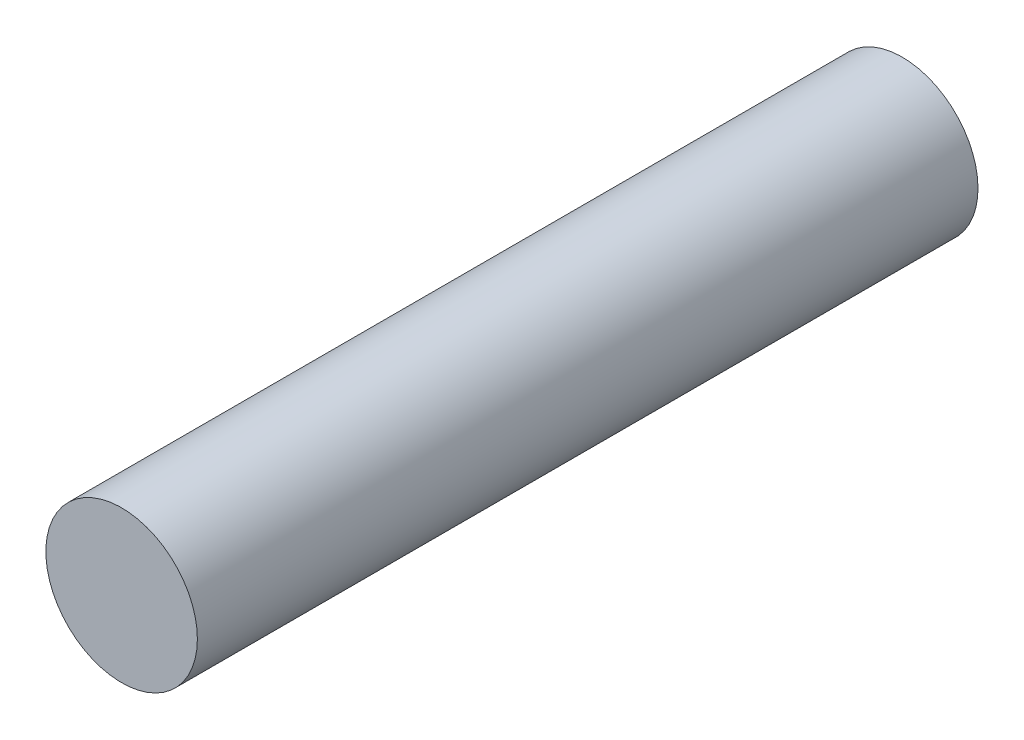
ISO-10303-21;
HEADER;
FILE_DESCRIPTION(('STEP AP214'),'2;1');
FILE_NAME('part.step','',(''),(''),'','','');
FILE_SCHEMA(('AUTOMOTIVE_DESIGN { 1 0 10303 214 1 1 1 1 }'));
ENDSEC;
DATA;
#1=APPLICATION_CONTEXT('core data for automotive mechanical design processes');
#2=APPLICATION_PROTOCOL_DEFINITION('international standard','automotive_design',2000,#1);
#3=PRODUCT_CONTEXT('',#1,'mechanical');
#4=PRODUCT('Part','Part','',(#3));
#5=PRODUCT_RELATED_PRODUCT_CATEGORY('part','',(#4));
#6=PRODUCT_DEFINITION_FORMATION('','',#4);
#7=PRODUCT_DEFINITION_CONTEXT('part definition',#1,'design');
#8=PRODUCT_DEFINITION('design','',#6,#7);
#9=PRODUCT_DEFINITION_SHAPE('','',#8);
#10=(LENGTH_UNIT() NAMED_UNIT(*) SI_UNIT(.MILLI.,.METRE.));
#11=(NAMED_UNIT(*) PLANE_ANGLE_UNIT() SI_UNIT($,.RADIAN.));
#12=(NAMED_UNIT(*) SI_UNIT($,.STERADIAN.) SOLID_ANGLE_UNIT());
#13=UNCERTAINTY_MEASURE_WITH_UNIT(LENGTH_MEASURE(1.E-05),#10,'distance_accuracy_value','');
#14=(GEOMETRIC_REPRESENTATION_CONTEXT(3) GLOBAL_UNCERTAINTY_ASSIGNED_CONTEXT((#13)) GLOBAL_UNIT_ASSIGNED_CONTEXT((#10,
#11,#12)) REPRESENTATION_CONTEXT('',''));
#15=CARTESIAN_POINT('',(0.,0.,0.));
#16=DIRECTION('',(0.,0.,1.));
#17=DIRECTION('',(1.,0.,0.));
#18=AXIS2_PLACEMENT_3D('',#15,#16,#17);
#19=CARTESIAN_POINT('',(15.24,0.,2.800000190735));
#20=DIRECTION('',(0.,0.,1.));
#21=DIRECTION('',(1.,0.,0.));
#22=AXIS2_PLACEMENT_3D('',#19,#20,#21);
#23=PLANE('',#22);
#24=CARTESIAN_POINT('',(15.24,0.,2.800000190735));
#25=DIRECTION('',(0.,0.,1.));
#26=DIRECTION('',(1.,0.,0.));
#27=AXIS2_PLACEMENT_3D('',#24,#25,#26);
#28=CIRCLE('',#27,0.660000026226);
#29=CARTESIAN_POINT('',(15.900000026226,0.,2.800000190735));
#30=VERTEX_POINT('',#29);
#31=EDGE_CURVE('E18',#30,#30,#28,.F.);
#32=ORIENTED_EDGE('',*,*,#31,.F.);
#33=EDGE_LOOP('',(#32));
#34=FACE_BOUND('',#33,.T.);
#35=ADVANCED_FACE('F15',(#34),#23,.T.);
#36=CARTESIAN_POINT('',(15.24,0.,-4.));
#37=DIRECTION('',(0.,0.,1.));
#38=DIRECTION('',(1.,0.,0.));
#39=AXIS2_PLACEMENT_3D('',#36,#37,#38);
#40=PLANE('',#39);
#41=CARTESIAN_POINT('',(15.24,0.,-4.));
#42=DIRECTION('',(0.,0.,1.));
#43=DIRECTION('',(1.,0.,0.));
#44=AXIS2_PLACEMENT_3D('',#41,#42,#43);
#45=CIRCLE('',#44,0.660000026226);
#46=CARTESIAN_POINT('',(15.900000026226,0.,-4.));
#47=VERTEX_POINT('',#46);
#48=EDGE_CURVE('E10',#47,#47,#45,.T.);
#49=ORIENTED_EDGE('',*,*,#48,.F.);
#50=EDGE_LOOP('',(#49));
#51=FACE_BOUND('',#50,.T.);
#52=ADVANCED_FACE('F30',(#51),#40,.F.);
#53=CARTESIAN_POINT('',(15.24,0.,-4.));
#54=DIRECTION('',(0.,0.,1.));
#55=DIRECTION('',(1.,0.,0.));
#56=AXIS2_PLACEMENT_3D('',#53,#54,#55);
#57=CYLINDRICAL_SURFACE('',#56,0.660000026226);
#58=ORIENTED_EDGE('',*,*,#48,.T.);
#59=EDGE_LOOP('',(#58));
#60=FACE_BOUND('',#59,.T.);
#61=ORIENTED_EDGE('',*,*,#31,.T.);
#62=EDGE_LOOP('',(#61));
#63=FACE_BOUND('',#62,.T.);
#64=ADVANCED_FACE('F27',(#60,#63),#57,.T.);
#65=CLOSED_SHELL('',(#35,#52,#64));
#66=MANIFOLD_SOLID_BREP('B1',#65);
#67=ADVANCED_BREP_SHAPE_REPRESENTATION('',(#18,#66),#14);
#68=SHAPE_DEFINITION_REPRESENTATION(#9,#67);
ENDSEC;
END-ISO-10303-21;
